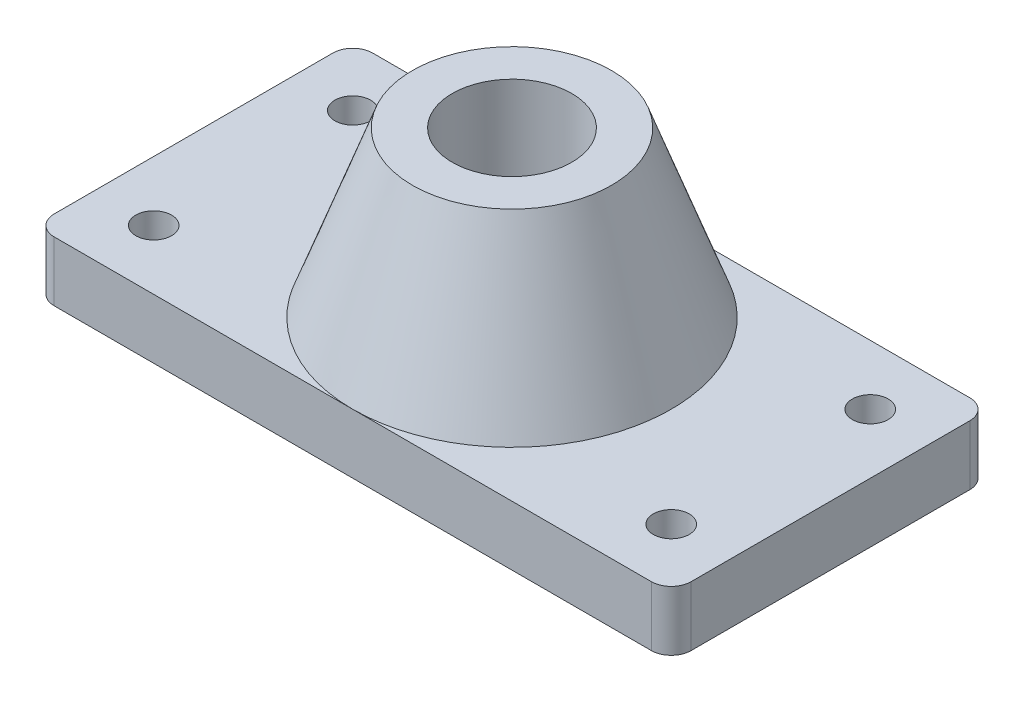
ISO-10303-21;
HEADER;
FILE_DESCRIPTION(('STEP AP214'),'2;1');
FILE_NAME('part.step','',(''),(''),'','','');
FILE_SCHEMA(('AUTOMOTIVE_DESIGN { 1 0 10303 214 1 1 1 1 }'));
ENDSEC;
DATA;
#1=APPLICATION_CONTEXT('core data for automotive mechanical design processes');
#2=APPLICATION_PROTOCOL_DEFINITION('international standard','automotive_design',2000,#1);
#3=PRODUCT_CONTEXT('',#1,'mechanical');
#4=PRODUCT('Part','Part','',(#3));
#5=PRODUCT_RELATED_PRODUCT_CATEGORY('part','',(#4));
#6=PRODUCT_DEFINITION_FORMATION('','',#4);
#7=PRODUCT_DEFINITION_CONTEXT('part definition',#1,'design');
#8=PRODUCT_DEFINITION('design','',#6,#7);
#9=PRODUCT_DEFINITION_SHAPE('','',#8);
#10=(LENGTH_UNIT() NAMED_UNIT(*) SI_UNIT(.MILLI.,.METRE.));
#11=(NAMED_UNIT(*) PLANE_ANGLE_UNIT() SI_UNIT($,.RADIAN.));
#12=(NAMED_UNIT(*) SI_UNIT($,.STERADIAN.) SOLID_ANGLE_UNIT());
#13=UNCERTAINTY_MEASURE_WITH_UNIT(LENGTH_MEASURE(1.E-05),#10,'distance_accuracy_value','');
#14=(GEOMETRIC_REPRESENTATION_CONTEXT(3) GLOBAL_UNCERTAINTY_ASSIGNED_CONTEXT((#13)) GLOBAL_UNIT_ASSIGNED_CONTEXT((#10,
#11,#12)) REPRESENTATION_CONTEXT('',''));
#15=CARTESIAN_POINT('',(0.,0.,0.));
#16=DIRECTION('',(0.,0.,1.));
#17=DIRECTION('',(1.,0.,0.));
#18=AXIS2_PLACEMENT_3D('',#15,#16,#17);
#19=CARTESIAN_POINT('',(0.,15.,0.));
#20=DIRECTION('',(0.,-1.,0.));
#21=DIRECTION('',(0.,0.,-1.));
#22=AXIS2_PLACEMENT_3D('',#19,#20,#21);
#23=PLANE('',#22);
#24=CARTESIAN_POINT('',(-15.,15.,-25.));
#25=DIRECTION('',(0.,-1.,0.));
#26=DIRECTION('',(0.,0.,-1.));
#27=AXIS2_PLACEMENT_3D('',#24,#25,#26);
#28=CIRCLE('',#27,4.49999999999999);
#29=CARTESIAN_POINT('',(-15.,15.,-29.5));
#30=VERTEX_POINT('',#29);
#31=EDGE_CURVE('E159',#30,#30,#28,.T.);
#32=ORIENTED_EDGE('',*,*,#31,.T.);
#33=EDGE_LOOP('',(#32));
#34=FACE_BOUND('',#33,.T.);
#35=CARTESIAN_POINT('',(-15.,15.,25.));
#36=DIRECTION('',(0.,-1.,0.));
#37=DIRECTION('',(0.,0.,-1.));
#38=AXIS2_PLACEMENT_3D('',#35,#36,#37);
#39=CIRCLE('',#38,4.49999999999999);
#40=CARTESIAN_POINT('',(-15.,15.,20.5));
#41=VERTEX_POINT('',#40);
#42=EDGE_CURVE('E154',#41,#41,#39,.T.);
#43=ORIENTED_EDGE('',*,*,#42,.T.);
#44=EDGE_LOOP('',(#43));
#45=FACE_BOUND('',#44,.T.);
#46=DIRECTION('',(0.,0.,-1.));
#47=VECTOR('',#46,1.);
#48=CARTESIAN_POINT('',(0.,15.,-40.));
#49=LINE('',#48,#47);
#50=CARTESIAN_POINT('',(0.,15.,35.));
#51=VERTEX_POINT('',#50);
#52=CARTESIAN_POINT('',(0.,15.,-35.));
#53=VERTEX_POINT('',#52);
#54=EDGE_CURVE('E150',#51,#53,#49,.T.);
#55=ORIENTED_EDGE('',*,*,#54,.T.);
#56=CARTESIAN_POINT('',(-5.,15.,-35.));
#57=DIRECTION('',(0.,-1.,0.));
#58=DIRECTION('',(0.,0.,-1.));
#59=AXIS2_PLACEMENT_3D('',#56,#57,#58);
#60=CIRCLE('',#59,5.);
#61=CARTESIAN_POINT('',(-5.,15.,-40.));
#62=VERTEX_POINT('',#61);
#63=EDGE_CURVE('E11',#53,#62,#60,.F.);
#64=ORIENTED_EDGE('',*,*,#63,.T.);
#65=DIRECTION('',(-1.,0.,0.));
#66=VECTOR('',#65,1.);
#67=CARTESIAN_POINT('',(-160.,15.,-40.));
#68=LINE('',#67,#66);
#69=CARTESIAN_POINT('',(-80.,15.,-40.));
#70=VERTEX_POINT('',#69);
#71=EDGE_CURVE('E128',#62,#70,#68,.T.);
#72=ORIENTED_EDGE('',*,*,#71,.T.);
#73=CARTESIAN_POINT('',(-80.,15.,0.));
#74=DIRECTION('',(0.,-1.,0.));
#75=DIRECTION('',(0.,0.,-1.));
#76=AXIS2_PLACEMENT_3D('',#73,#74,#75);
#77=CIRCLE('',#76,40.);
#78=CARTESIAN_POINT('',(-80.,15.,40.));
#79=VERTEX_POINT('',#78);
#80=EDGE_CURVE('E124',#70,#79,#77,.T.);
#81=ORIENTED_EDGE('',*,*,#80,.T.);
#82=DIRECTION('',(1.,0.,0.));
#83=VECTOR('',#82,1.);
#84=CARTESIAN_POINT('',(0.,15.,40.));
#85=LINE('',#84,#83);
#86=CARTESIAN_POINT('',(-5.,15.,40.));
#87=VERTEX_POINT('',#86);
#88=EDGE_CURVE('E117',#79,#87,#85,.T.);
#89=ORIENTED_EDGE('',*,*,#88,.T.);
#90=CARTESIAN_POINT('',(-5.,15.,35.));
#91=DIRECTION('',(0.,-1.,0.));
#92=DIRECTION('',(0.,0.,-1.));
#93=AXIS2_PLACEMENT_3D('',#90,#91,#92);
#94=CIRCLE('',#93,5.);
#95=EDGE_CURVE('E41',#87,#51,#94,.F.);
#96=ORIENTED_EDGE('',*,*,#95,.T.);
#97=EDGE_LOOP('',(#55,#64,#72,#81,#89,#96));
#98=FACE_BOUND('',#97,.T.);
#99=ADVANCED_FACE('F33',(#34,#45,#98),#23,.F.);
#100=CARTESIAN_POINT('',(-160.,15.,-40.));
#101=DIRECTION('',(0.,0.,1.));
#102=DIRECTION('',(1.,0.,0.));
#103=AXIS2_PLACEMENT_3D('',#100,#101,#102);
#104=PLANE('',#103);
#105=DIRECTION('',(-1.,0.,0.));
#106=VECTOR('',#105,1.);
#107=CARTESIAN_POINT('',(-160.,0.,-40.));
#108=LINE('',#107,#106);
#109=CARTESIAN_POINT('',(-5.,0.,-40.));
#110=VERTEX_POINT('',#109);
#111=CARTESIAN_POINT('',(-155.,0.,-40.));
#112=VERTEX_POINT('',#111);
#113=EDGE_CURVE('E139',#110,#112,#108,.T.);
#114=ORIENTED_EDGE('',*,*,#113,.T.);
#115=DIRECTION('',(0.,-1.,0.));
#116=VECTOR('',#115,1.);
#117=CARTESIAN_POINT('',(-155.,15.,-40.));
#118=LINE('',#117,#116);
#119=CARTESIAN_POINT('',(-155.,15.,-40.));
#120=VERTEX_POINT('',#119);
#121=EDGE_CURVE('E184',#112,#120,#118,.F.);
#122=ORIENTED_EDGE('',*,*,#121,.T.);
#123=EDGE_CURVE('E211',#70,#120,#68,.T.);
#124=ORIENTED_EDGE('',*,*,#123,.F.);
#125=ORIENTED_EDGE('',*,*,#71,.F.);
#126=DIRECTION('',(0.,-1.,0.));
#127=VECTOR('',#126,1.);
#128=CARTESIAN_POINT('',(-5.,15.,-40.));
#129=LINE('',#128,#127);
#130=EDGE_CURVE('E181',#62,#110,#129,.T.);
#131=ORIENTED_EDGE('',*,*,#130,.T.);
#132=EDGE_LOOP('',(#114,#122,#124,#125,#131));
#133=FACE_BOUND('',#132,.T.);
#134=ADVANCED_FACE('F209',(#133),#104,.F.);
#135=CARTESIAN_POINT('',(-160.,15.,40.));
#136=DIRECTION('',(1.,0.,0.));
#137=DIRECTION('',(0.,0.,-1.));
#138=AXIS2_PLACEMENT_3D('',#135,#136,#137);
#139=PLANE('',#138);
#140=DIRECTION('',(0.,0.,1.));
#141=VECTOR('',#140,1.);
#142=CARTESIAN_POINT('',(-160.,15.,40.));
#143=LINE('',#142,#141);
#144=CARTESIAN_POINT('',(-160.,15.,-35.));
#145=VERTEX_POINT('',#144);
#146=CARTESIAN_POINT('',(-160.,15.,35.));
#147=VERTEX_POINT('',#146);
#148=EDGE_CURVE('E135',#145,#147,#143,.T.);
#149=ORIENTED_EDGE('',*,*,#148,.F.);
#150=DIRECTION('',(0.,-1.,0.));
#151=VECTOR('',#150,1.);
#152=CARTESIAN_POINT('',(-160.,15.,-35.));
#153=LINE('',#152,#151);
#154=CARTESIAN_POINT('',(-160.,0.,-35.));
#155=VERTEX_POINT('',#154);
#156=EDGE_CURVE('E170',#145,#155,#153,.T.);
#157=ORIENTED_EDGE('',*,*,#156,.T.);
#158=DIRECTION('',(0.,0.,1.));
#159=VECTOR('',#158,1.);
#160=CARTESIAN_POINT('',(-160.,0.,40.));
#161=LINE('',#160,#159);
#162=CARTESIAN_POINT('',(-160.,0.,35.));
#163=VERTEX_POINT('',#162);
#164=EDGE_CURVE('E142',#155,#163,#161,.T.);
#165=ORIENTED_EDGE('',*,*,#164,.T.);
#166=DIRECTION('',(0.,-1.,0.));
#167=VECTOR('',#166,1.);
#168=CARTESIAN_POINT('',(-160.,15.,35.));
#169=LINE('',#168,#167);
#170=EDGE_CURVE('E125',#163,#147,#169,.F.);
#171=ORIENTED_EDGE('',*,*,#170,.T.);
#172=EDGE_LOOP('',(#149,#157,#165,#171));
#173=FACE_BOUND('',#172,.T.);
#174=ADVANCED_FACE('F275',(#173),#139,.F.);
#175=CARTESIAN_POINT('',(0.,15.,40.));
#176=DIRECTION('',(0.,0.,-1.));
#177=DIRECTION('',(-1.,0.,0.));
#178=AXIS2_PLACEMENT_3D('',#175,#176,#177);
#179=PLANE('',#178);
#180=CARTESIAN_POINT('',(-155.,15.,40.));
#181=VERTEX_POINT('',#180);
#182=EDGE_CURVE('E104',#181,#79,#85,.T.);
#183=ORIENTED_EDGE('',*,*,#182,.F.);
#184=DIRECTION('',(0.,-1.,0.));
#185=VECTOR('',#184,1.);
#186=CARTESIAN_POINT('',(-155.,15.,40.));
#187=LINE('',#186,#185);
#188=CARTESIAN_POINT('',(-155.,0.,40.));
#189=VERTEX_POINT('',#188);
#190=EDGE_CURVE('E190',#181,#189,#187,.T.);
#191=ORIENTED_EDGE('',*,*,#190,.T.);
#192=DIRECTION('',(1.,0.,0.));
#193=VECTOR('',#192,1.);
#194=CARTESIAN_POINT('',(0.,0.,40.));
#195=LINE('',#194,#193);
#196=CARTESIAN_POINT('',(-5.,0.,40.));
#197=VERTEX_POINT('',#196);
#198=EDGE_CURVE('E146',#189,#197,#195,.T.);
#199=ORIENTED_EDGE('',*,*,#198,.T.);
#200=DIRECTION('',(0.,-1.,0.));
#201=VECTOR('',#200,1.);
#202=CARTESIAN_POINT('',(-5.,15.,40.));
#203=LINE('',#202,#201);
#204=EDGE_CURVE('E134',#197,#87,#203,.F.);
#205=ORIENTED_EDGE('',*,*,#204,.T.);
#206=ORIENTED_EDGE('',*,*,#88,.F.);
#207=EDGE_LOOP('',(#183,#191,#199,#205,#206));
#208=FACE_BOUND('',#207,.T.);
#209=ADVANCED_FACE('F131',(#208),#179,.F.);
#210=CARTESIAN_POINT('',(0.,15.,0.));
#211=DIRECTION('',(-1.,0.,0.));
#212=DIRECTION('',(0.,0.,1.));
#213=AXIS2_PLACEMENT_3D('',#210,#211,#212);
#214=PLANE('',#213);
#215=DIRECTION('',(0.,0.,-1.));
#216=VECTOR('',#215,1.);
#217=CARTESIAN_POINT('',(0.,0.,0.));
#218=LINE('',#217,#216);
#219=CARTESIAN_POINT('',(0.,0.,35.));
#220=VERTEX_POINT('',#219);
#221=CARTESIAN_POINT('',(0.,0.,-35.));
#222=VERTEX_POINT('',#221);
#223=EDGE_CURVE('E148',#220,#222,#218,.T.);
#224=ORIENTED_EDGE('',*,*,#223,.T.);
#225=DIRECTION('',(0.,-1.,0.));
#226=VECTOR('',#225,1.);
#227=CARTESIAN_POINT('',(0.,15.,-35.));
#228=LINE('',#227,#226);
#229=EDGE_CURVE('E48',#222,#53,#228,.F.);
#230=ORIENTED_EDGE('',*,*,#229,.T.);
#231=ORIENTED_EDGE('',*,*,#54,.F.);
#232=DIRECTION('',(0.,-1.,0.));
#233=VECTOR('',#232,1.);
#234=CARTESIAN_POINT('',(0.,15.,35.));
#235=LINE('',#234,#233);
#236=EDGE_CURVE('E192',#51,#220,#235,.T.);
#237=ORIENTED_EDGE('',*,*,#236,.T.);
#238=EDGE_LOOP('',(#224,#230,#231,#237));
#239=FACE_BOUND('',#238,.T.);
#240=ADVANCED_FACE('F197',(#239),#214,.F.);
#241=CARTESIAN_POINT('',(-145.,15.,-25.));
#242=DIRECTION('',(0.,-1.,0.));
#243=DIRECTION('',(0.,0.,-1.));
#244=AXIS2_PLACEMENT_3D('',#241,#242,#243);
#245=CIRCLE('',#244,4.49999999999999);
#246=CARTESIAN_POINT('',(-145.,15.,-29.5));
#247=VERTEX_POINT('',#246);
#248=EDGE_CURVE('E164',#247,#247,#245,.T.);
#249=ORIENTED_EDGE('',*,*,#248,.T.);
#250=EDGE_LOOP('',(#249));
#251=FACE_BOUND('',#250,.T.);
#252=CARTESIAN_POINT('',(-145.,15.,25.));
#253=DIRECTION('',(0.,-1.,0.));
#254=DIRECTION('',(0.,0.,-1.));
#255=AXIS2_PLACEMENT_3D('',#252,#253,#254);
#256=CIRCLE('',#255,4.49999999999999);
#257=CARTESIAN_POINT('',(-145.,15.,20.5));
#258=VERTEX_POINT('',#257);
#259=EDGE_CURVE('E130',#258,#258,#256,.T.);
#260=ORIENTED_EDGE('',*,*,#259,.T.);
#261=EDGE_LOOP('',(#260));
#262=FACE_BOUND('',#261,.T.);
#263=ORIENTED_EDGE('',*,*,#123,.T.);
#264=CARTESIAN_POINT('',(-155.,15.,-35.));
#265=DIRECTION('',(0.,-1.,0.));
#266=DIRECTION('',(0.,0.,-1.));
#267=AXIS2_PLACEMENT_3D('',#264,#265,#266);
#268=CIRCLE('',#267,5.);
#269=EDGE_CURVE('E187',#120,#145,#268,.F.);
#270=ORIENTED_EDGE('',*,*,#269,.T.);
#271=ORIENTED_EDGE('',*,*,#148,.T.);
#272=CARTESIAN_POINT('',(-155.,15.,35.));
#273=DIRECTION('',(0.,-1.,0.));
#274=DIRECTION('',(0.,0.,-1.));
#275=AXIS2_PLACEMENT_3D('',#272,#273,#274);
#276=CIRCLE('',#275,5.);
#277=EDGE_CURVE('E112',#147,#181,#276,.F.);
#278=ORIENTED_EDGE('',*,*,#277,.T.);
#279=ORIENTED_EDGE('',*,*,#182,.T.);
#280=EDGE_CURVE('E108',#79,#70,#77,.T.);
#281=ORIENTED_EDGE('',*,*,#280,.T.);
#282=EDGE_LOOP('',(#263,#270,#271,#278,#279,#281));
#283=FACE_BOUND('',#282,.T.);
#284=ADVANCED_FACE('F107',(#251,#262,#283),#23,.F.);
#285=CARTESIAN_POINT('',(0.,0.,0.));
#286=DIRECTION('',(0.,-1.,0.));
#287=DIRECTION('',(0.,0.,-1.));
#288=AXIS2_PLACEMENT_3D('',#285,#286,#287);
#289=PLANE('',#288);
#290=CARTESIAN_POINT('',(-80.,0.,0.));
#291=DIRECTION('',(0.,1.,0.));
#292=DIRECTION('',(0.,0.,1.));
#293=AXIS2_PLACEMENT_3D('',#290,#291,#292);
#294=CIRCLE('',#293,15.);
#295=CARTESIAN_POINT('',(-80.,0.,15.));
#296=VERTEX_POINT('',#295);
#297=EDGE_CURVE('E247',#296,#296,#294,.T.);
#298=ORIENTED_EDGE('',*,*,#297,.T.);
#299=EDGE_LOOP('',(#298));
#300=FACE_BOUND('',#299,.T.);
#301=CARTESIAN_POINT('',(-145.,0.,-25.));
#302=DIRECTION('',(0.,-1.,0.));
#303=DIRECTION('',(0.,0.,-1.));
#304=AXIS2_PLACEMENT_3D('',#301,#302,#303);
#305=CIRCLE('',#304,7.50000000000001);
#306=CARTESIAN_POINT('',(-145.,0.,-32.5));
#307=VERTEX_POINT('',#306);
#308=EDGE_CURVE('E244',#307,#307,#305,.T.);
#309=ORIENTED_EDGE('',*,*,#308,.F.);
#310=EDGE_LOOP('',(#309));
#311=FACE_BOUND('',#310,.T.);
#312=CARTESIAN_POINT('',(-15.,0.,-25.));
#313=DIRECTION('',(0.,-1.,0.));
#314=DIRECTION('',(0.,0.,-1.));
#315=AXIS2_PLACEMENT_3D('',#312,#313,#314);
#316=CIRCLE('',#315,7.5);
#317=CARTESIAN_POINT('',(-15.,0.,-32.5));
#318=VERTEX_POINT('',#317);
#319=EDGE_CURVE('E167',#318,#318,#316,.T.);
#320=ORIENTED_EDGE('',*,*,#319,.F.);
#321=EDGE_LOOP('',(#320));
#322=FACE_BOUND('',#321,.T.);
#323=CARTESIAN_POINT('',(-15.,0.,25.));
#324=DIRECTION('',(0.,-1.,0.));
#325=DIRECTION('',(0.,0.,-1.));
#326=AXIS2_PLACEMENT_3D('',#323,#324,#325);
#327=CIRCLE('',#326,7.5);
#328=CARTESIAN_POINT('',(-15.,0.,17.5));
#329=VERTEX_POINT('',#328);
#330=EDGE_CURVE('E162',#329,#329,#327,.T.);
#331=ORIENTED_EDGE('',*,*,#330,.F.);
#332=EDGE_LOOP('',(#331));
#333=FACE_BOUND('',#332,.T.);
#334=CARTESIAN_POINT('',(-145.,0.,25.));
#335=DIRECTION('',(0.,-1.,0.));
#336=DIRECTION('',(0.,0.,-1.));
#337=AXIS2_PLACEMENT_3D('',#334,#335,#336);
#338=CIRCLE('',#337,7.50000000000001);
#339=CARTESIAN_POINT('',(-145.,0.,17.5));
#340=VERTEX_POINT('',#339);
#341=EDGE_CURVE('E157',#340,#340,#338,.T.);
#342=ORIENTED_EDGE('',*,*,#341,.F.);
#343=EDGE_LOOP('',(#342));
#344=FACE_BOUND('',#343,.T.);
#345=ORIENTED_EDGE('',*,*,#164,.F.);
#346=CARTESIAN_POINT('',(-155.,0.,-35.));
#347=DIRECTION('',(0.,-1.,0.));
#348=DIRECTION('',(0.,0.,-1.));
#349=AXIS2_PLACEMENT_3D('',#346,#347,#348);
#350=CIRCLE('',#349,5.);
#351=EDGE_CURVE('E179',#155,#112,#350,.T.);
#352=ORIENTED_EDGE('',*,*,#351,.T.);
#353=ORIENTED_EDGE('',*,*,#113,.F.);
#354=CARTESIAN_POINT('',(-5.,0.,-35.));
#355=DIRECTION('',(0.,-1.,0.));
#356=DIRECTION('',(0.,0.,-1.));
#357=AXIS2_PLACEMENT_3D('',#354,#355,#356);
#358=CIRCLE('',#357,5.);
#359=EDGE_CURVE('E175',#110,#222,#358,.T.);
#360=ORIENTED_EDGE('',*,*,#359,.T.);
#361=ORIENTED_EDGE('',*,*,#223,.F.);
#362=CARTESIAN_POINT('',(-5.,0.,35.));
#363=DIRECTION('',(0.,-1.,0.));
#364=DIRECTION('',(0.,0.,-1.));
#365=AXIS2_PLACEMENT_3D('',#362,#363,#364);
#366=CIRCLE('',#365,5.);
#367=EDGE_CURVE('E173',#220,#197,#366,.T.);
#368=ORIENTED_EDGE('',*,*,#367,.T.);
#369=ORIENTED_EDGE('',*,*,#198,.F.);
#370=CARTESIAN_POINT('',(-155.,0.,35.));
#371=DIRECTION('',(0.,-1.,0.));
#372=DIRECTION('',(0.,0.,-1.));
#373=AXIS2_PLACEMENT_3D('',#370,#371,#372);
#374=CIRCLE('',#373,5.);
#375=EDGE_CURVE('E177',#189,#163,#374,.T.);
#376=ORIENTED_EDGE('',*,*,#375,.T.);
#377=EDGE_LOOP('',(#345,#352,#353,#360,#361,#368,#369,#376));
#378=FACE_BOUND('',#377,.T.);
#379=ADVANCED_FACE('F201',(#300,#311,#322,#333,#344,#378),#289,.T.);
#380=CARTESIAN_POINT('',(-80.,56.2121612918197,0.));
#381=DIRECTION('',(0.,-1.,0.));
#382=DIRECTION('',(0.,0.,-1.));
#383=AXIS2_PLACEMENT_3D('',#380,#381,#382);
#384=CONICAL_SURFACE('',#383,25.,0.349065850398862);
#385=ORIENTED_EDGE('',*,*,#80,.F.);
#386=ORIENTED_EDGE('',*,*,#280,.F.);
#387=EDGE_LOOP('',(#385,#386));
#388=FACE_BOUND('',#387,.T.);
#389=CARTESIAN_POINT('',(-80.,56.2121612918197,0.));
#390=DIRECTION('',(0.,-1.,0.));
#391=DIRECTION('',(0.,0.,-1.));
#392=AXIS2_PLACEMENT_3D('',#389,#390,#391);
#393=CIRCLE('',#392,25.);
#394=CARTESIAN_POINT('',(-80.,56.2121612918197,-25.));
#395=VERTEX_POINT('',#394);
#396=EDGE_CURVE('E143',#395,#395,#393,.T.);
#397=ORIENTED_EDGE('',*,*,#396,.T.);
#398=EDGE_LOOP('',(#397));
#399=FACE_BOUND('',#398,.T.);
#400=ADVANCED_FACE('F122',(#388,#399),#384,.T.);
#401=CARTESIAN_POINT('',(-105.,56.2121612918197,0.));
#402=DIRECTION('',(0.,-1.,0.));
#403=DIRECTION('',(0.,0.,-1.));
#404=AXIS2_PLACEMENT_3D('',#401,#402,#403);
#405=PLANE('',#404);
#406=ORIENTED_EDGE('',*,*,#396,.F.);
#407=EDGE_LOOP('',(#406));
#408=FACE_BOUND('',#407,.T.);
#409=CARTESIAN_POINT('',(-80.,56.2121612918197,0.));
#410=DIRECTION('',(0.,-1.,0.));
#411=DIRECTION('',(0.,0.,-1.));
#412=AXIS2_PLACEMENT_3D('',#409,#410,#411);
#413=CIRCLE('',#412,15.);
#414=CARTESIAN_POINT('',(-80.,56.2121612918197,-15.));
#415=VERTEX_POINT('',#414);
#416=EDGE_CURVE('E129',#415,#415,#413,.T.);
#417=ORIENTED_EDGE('',*,*,#416,.T.);
#418=EDGE_LOOP('',(#417));
#419=FACE_BOUND('',#418,.T.);
#420=ADVANCED_FACE('F256',(#408,#419),#405,.F.);
#421=CARTESIAN_POINT('',(-80.,0.,0.));
#422=DIRECTION('',(0.,-1.,0.));
#423=DIRECTION('',(0.,0.,-1.));
#424=AXIS2_PLACEMENT_3D('',#421,#422,#423);
#425=CYLINDRICAL_SURFACE('',#424,15.);
#426=ORIENTED_EDGE('',*,*,#416,.F.);
#427=EDGE_LOOP('',(#426));
#428=FACE_BOUND('',#427,.T.);
#429=ORIENTED_EDGE('',*,*,#297,.F.);
#430=EDGE_LOOP('',(#429));
#431=FACE_BOUND('',#430,.T.);
#432=ADVANCED_FACE('F253',(#428,#431),#425,.F.);
#433=CARTESIAN_POINT('',(-145.,0.,25.));
#434=DIRECTION('',(0.,-1.,0.));
#435=DIRECTION('',(0.,0.,-1.));
#436=AXIS2_PLACEMENT_3D('',#433,#434,#435);
#437=CYLINDRICAL_SURFACE('',#436,4.49999999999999);
#438=CARTESIAN_POINT('',(-145.,8.6,25.));
#439=DIRECTION('',(0.,-1.,0.));
#440=DIRECTION('',(0.,0.,-1.));
#441=AXIS2_PLACEMENT_3D('',#438,#439,#440);
#442=CIRCLE('',#441,4.5);
#443=CARTESIAN_POINT('',(-145.,8.6,20.5));
#444=VERTEX_POINT('',#443);
#445=EDGE_CURVE('E153',#444,#444,#442,.T.);
#446=ORIENTED_EDGE('',*,*,#445,.T.);
#447=EDGE_LOOP('',(#446));
#448=FACE_BOUND('',#447,.T.);
#449=ORIENTED_EDGE('',*,*,#259,.F.);
#450=EDGE_LOOP('',(#449));
#451=FACE_BOUND('',#450,.T.);
#452=ADVANCED_FACE('F255',(#448,#451),#437,.F.);
#453=CARTESIAN_POINT('',(-140.5,8.6,25.));
#454=DIRECTION('',(0.,1.,0.));
#455=DIRECTION('',(0.,0.,1.));
#456=AXIS2_PLACEMENT_3D('',#453,#454,#455);
#457=PLANE('',#456);
#458=ORIENTED_EDGE('',*,*,#445,.F.);
#459=EDGE_LOOP('',(#458));
#460=FACE_BOUND('',#459,.T.);
#461=CARTESIAN_POINT('',(-145.,8.6,25.));
#462=DIRECTION('',(0.,-1.,0.));
#463=DIRECTION('',(0.,0.,-1.));
#464=AXIS2_PLACEMENT_3D('',#461,#462,#463);
#465=CIRCLE('',#464,7.50000000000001);
#466=CARTESIAN_POINT('',(-145.,8.6,17.5));
#467=VERTEX_POINT('',#466);
#468=EDGE_CURVE('E220',#467,#467,#465,.T.);
#469=ORIENTED_EDGE('',*,*,#468,.T.);
#470=EDGE_LOOP('',(#469));
#471=FACE_BOUND('',#470,.T.);
#472=ADVANCED_FACE('F263',(#460,#471),#457,.F.);
#473=CARTESIAN_POINT('',(-145.,0.,25.));
#474=DIRECTION('',(0.,-1.,0.));
#475=DIRECTION('',(0.,0.,-1.));
#476=AXIS2_PLACEMENT_3D('',#473,#474,#475);
#477=CYLINDRICAL_SURFACE('',#476,7.50000000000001);
#478=ORIENTED_EDGE('',*,*,#468,.F.);
#479=EDGE_LOOP('',(#478));
#480=FACE_BOUND('',#479,.T.);
#481=ORIENTED_EDGE('',*,*,#341,.T.);
#482=EDGE_LOOP('',(#481));
#483=FACE_BOUND('',#482,.T.);
#484=ADVANCED_FACE('F328',(#480,#483),#477,.F.);
#485=CARTESIAN_POINT('',(-15.,0.,25.));
#486=DIRECTION('',(0.,-1.,0.));
#487=DIRECTION('',(0.,0.,-1.));
#488=AXIS2_PLACEMENT_3D('',#485,#486,#487);
#489=CYLINDRICAL_SURFACE('',#488,4.49999999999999);
#490=CARTESIAN_POINT('',(-15.,8.6,25.));
#491=DIRECTION('',(0.,-1.,0.));
#492=DIRECTION('',(0.,0.,-1.));
#493=AXIS2_PLACEMENT_3D('',#490,#491,#492);
#494=CIRCLE('',#493,4.5);
#495=CARTESIAN_POINT('',(-15.,8.6,20.5));
#496=VERTEX_POINT('',#495);
#497=EDGE_CURVE('E158',#496,#496,#494,.T.);
#498=ORIENTED_EDGE('',*,*,#497,.T.);
#499=EDGE_LOOP('',(#498));
#500=FACE_BOUND('',#499,.T.);
#501=ORIENTED_EDGE('',*,*,#42,.F.);
#502=EDGE_LOOP('',(#501));
#503=FACE_BOUND('',#502,.T.);
#504=ADVANCED_FACE('F324',(#500,#503),#489,.F.);
#505=CARTESIAN_POINT('',(-10.5,8.6,25.));
#506=DIRECTION('',(0.,1.,0.));
#507=DIRECTION('',(0.,0.,1.));
#508=AXIS2_PLACEMENT_3D('',#505,#506,#507);
#509=PLANE('',#508);
#510=ORIENTED_EDGE('',*,*,#497,.F.);
#511=EDGE_LOOP('',(#510));
#512=FACE_BOUND('',#511,.T.);
#513=CARTESIAN_POINT('',(-15.,8.6,25.));
#514=DIRECTION('',(0.,-1.,0.));
#515=DIRECTION('',(0.,0.,-1.));
#516=AXIS2_PLACEMENT_3D('',#513,#514,#515);
#517=CIRCLE('',#516,7.5);
#518=CARTESIAN_POINT('',(-15.,8.6,17.5));
#519=VERTEX_POINT('',#518);
#520=EDGE_CURVE('E227',#519,#519,#517,.T.);
#521=ORIENTED_EDGE('',*,*,#520,.T.);
#522=EDGE_LOOP('',(#521));
#523=FACE_BOUND('',#522,.T.);
#524=ADVANCED_FACE('F320',(#512,#523),#509,.F.);
#525=CARTESIAN_POINT('',(-15.,0.,25.));
#526=DIRECTION('',(0.,-1.,0.));
#527=DIRECTION('',(0.,0.,-1.));
#528=AXIS2_PLACEMENT_3D('',#525,#526,#527);
#529=CYLINDRICAL_SURFACE('',#528,7.5);
#530=ORIENTED_EDGE('',*,*,#520,.F.);
#531=EDGE_LOOP('',(#530));
#532=FACE_BOUND('',#531,.T.);
#533=ORIENTED_EDGE('',*,*,#330,.T.);
#534=EDGE_LOOP('',(#533));
#535=FACE_BOUND('',#534,.T.);
#536=ADVANCED_FACE('F316',(#532,#535),#529,.F.);
#537=CARTESIAN_POINT('',(-15.,0.,-25.));
#538=DIRECTION('',(0.,-1.,0.));
#539=DIRECTION('',(0.,0.,-1.));
#540=AXIS2_PLACEMENT_3D('',#537,#538,#539);
#541=CYLINDRICAL_SURFACE('',#540,4.49999999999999);
#542=CARTESIAN_POINT('',(-15.,8.6,-25.));
#543=DIRECTION('',(0.,-1.,0.));
#544=DIRECTION('',(0.,0.,-1.));
#545=AXIS2_PLACEMENT_3D('',#542,#543,#544);
#546=CIRCLE('',#545,4.5);
#547=CARTESIAN_POINT('',(-15.,8.6,-29.5));
#548=VERTEX_POINT('',#547);
#549=EDGE_CURVE('E163',#548,#548,#546,.T.);
#550=ORIENTED_EDGE('',*,*,#549,.T.);
#551=EDGE_LOOP('',(#550));
#552=FACE_BOUND('',#551,.T.);
#553=ORIENTED_EDGE('',*,*,#31,.F.);
#554=EDGE_LOOP('',(#553));
#555=FACE_BOUND('',#554,.T.);
#556=ADVANCED_FACE('F312',(#552,#555),#541,.F.);
#557=CARTESIAN_POINT('',(-10.5,8.6,-25.));
#558=DIRECTION('',(0.,1.,0.));
#559=DIRECTION('',(0.,0.,1.));
#560=AXIS2_PLACEMENT_3D('',#557,#558,#559);
#561=PLANE('',#560);
#562=ORIENTED_EDGE('',*,*,#549,.F.);
#563=EDGE_LOOP('',(#562));
#564=FACE_BOUND('',#563,.T.);
#565=CARTESIAN_POINT('',(-15.,8.6,-25.));
#566=DIRECTION('',(0.,-1.,0.));
#567=DIRECTION('',(0.,0.,-1.));
#568=AXIS2_PLACEMENT_3D('',#565,#566,#567);
#569=CIRCLE('',#568,7.5);
#570=CARTESIAN_POINT('',(-15.,8.6,-32.5));
#571=VERTEX_POINT('',#570);
#572=EDGE_CURVE('E234',#571,#571,#569,.T.);
#573=ORIENTED_EDGE('',*,*,#572,.T.);
#574=EDGE_LOOP('',(#573));
#575=FACE_BOUND('',#574,.T.);
#576=ADVANCED_FACE('F305',(#564,#575),#561,.F.);
#577=CARTESIAN_POINT('',(-15.,0.,-25.));
#578=DIRECTION('',(0.,-1.,0.));
#579=DIRECTION('',(0.,0.,-1.));
#580=AXIS2_PLACEMENT_3D('',#577,#578,#579);
#581=CYLINDRICAL_SURFACE('',#580,7.5);
#582=ORIENTED_EDGE('',*,*,#572,.F.);
#583=EDGE_LOOP('',(#582));
#584=FACE_BOUND('',#583,.T.);
#585=ORIENTED_EDGE('',*,*,#319,.T.);
#586=EDGE_LOOP('',(#585));
#587=FACE_BOUND('',#586,.T.);
#588=ADVANCED_FACE('F295',(#584,#587),#581,.F.);
#589=CARTESIAN_POINT('',(-145.,0.,-25.));
#590=DIRECTION('',(0.,-1.,0.));
#591=DIRECTION('',(0.,0.,-1.));
#592=AXIS2_PLACEMENT_3D('',#589,#590,#591);
#593=CYLINDRICAL_SURFACE('',#592,4.49999999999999);
#594=CARTESIAN_POINT('',(-145.,8.6,-25.));
#595=DIRECTION('',(0.,-1.,0.));
#596=DIRECTION('',(0.,0.,-1.));
#597=AXIS2_PLACEMENT_3D('',#594,#595,#596);
#598=CIRCLE('',#597,4.5);
#599=CARTESIAN_POINT('',(-145.,8.6,-29.5));
#600=VERTEX_POINT('',#599);
#601=EDGE_CURVE('E168',#600,#600,#598,.T.);
#602=ORIENTED_EDGE('',*,*,#601,.T.);
#603=EDGE_LOOP('',(#602));
#604=FACE_BOUND('',#603,.T.);
#605=ORIENTED_EDGE('',*,*,#248,.F.);
#606=EDGE_LOOP('',(#605));
#607=FACE_BOUND('',#606,.T.);
#608=ADVANCED_FACE('F292',(#604,#607),#593,.F.);
#609=CARTESIAN_POINT('',(-140.5,8.6,-25.));
#610=DIRECTION('',(0.,1.,0.));
#611=DIRECTION('',(0.,0.,1.));
#612=AXIS2_PLACEMENT_3D('',#609,#610,#611);
#613=PLANE('',#612);
#614=ORIENTED_EDGE('',*,*,#601,.F.);
#615=EDGE_LOOP('',(#614));
#616=FACE_BOUND('',#615,.T.);
#617=CARTESIAN_POINT('',(-145.,8.6,-25.));
#618=DIRECTION('',(0.,-1.,0.));
#619=DIRECTION('',(0.,0.,-1.));
#620=AXIS2_PLACEMENT_3D('',#617,#618,#619);
#621=CIRCLE('',#620,7.50000000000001);
#622=CARTESIAN_POINT('',(-145.,8.6,-32.5));
#623=VERTEX_POINT('',#622);
#624=EDGE_CURVE('E241',#623,#623,#621,.T.);
#625=ORIENTED_EDGE('',*,*,#624,.T.);
#626=EDGE_LOOP('',(#625));
#627=FACE_BOUND('',#626,.T.);
#628=ADVANCED_FACE('F294',(#616,#627),#613,.F.);
#629=CARTESIAN_POINT('',(-145.,0.,-25.));
#630=DIRECTION('',(0.,-1.,0.));
#631=DIRECTION('',(0.,0.,-1.));
#632=AXIS2_PLACEMENT_3D('',#629,#630,#631);
#633=CYLINDRICAL_SURFACE('',#632,7.50000000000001);
#634=ORIENTED_EDGE('',*,*,#624,.F.);
#635=EDGE_LOOP('',(#634));
#636=FACE_BOUND('',#635,.T.);
#637=ORIENTED_EDGE('',*,*,#308,.T.);
#638=EDGE_LOOP('',(#637));
#639=FACE_BOUND('',#638,.T.);
#640=ADVANCED_FACE('F302',(#636,#639),#633,.F.);
#641=CARTESIAN_POINT('',(-155.,15.,-35.));
#642=DIRECTION('',(0.,-1.,0.));
#643=DIRECTION('',(0.,0.,-1.));
#644=AXIS2_PLACEMENT_3D('',#641,#642,#643);
#645=CYLINDRICAL_SURFACE('',#644,5.);
#646=ORIENTED_EDGE('',*,*,#269,.F.);
#647=ORIENTED_EDGE('',*,*,#121,.F.);
#648=ORIENTED_EDGE('',*,*,#351,.F.);
#649=ORIENTED_EDGE('',*,*,#156,.F.);
#650=EDGE_LOOP('',(#646,#647,#648,#649));
#651=FACE_BOUND('',#650,.T.);
#652=ADVANCED_FACE('F391',(#651),#645,.T.);
#653=CARTESIAN_POINT('',(-155.,15.,35.));
#654=DIRECTION('',(0.,-1.,0.));
#655=DIRECTION('',(0.,0.,-1.));
#656=AXIS2_PLACEMENT_3D('',#653,#654,#655);
#657=CYLINDRICAL_SURFACE('',#656,5.);
#658=ORIENTED_EDGE('',*,*,#277,.F.);
#659=ORIENTED_EDGE('',*,*,#170,.F.);
#660=ORIENTED_EDGE('',*,*,#375,.F.);
#661=ORIENTED_EDGE('',*,*,#190,.F.);
#662=EDGE_LOOP('',(#658,#659,#660,#661));
#663=FACE_BOUND('',#662,.T.);
#664=ADVANCED_FACE('F441',(#663),#657,.T.);
#665=CARTESIAN_POINT('',(-5.,15.,-35.));
#666=DIRECTION('',(0.,-1.,0.));
#667=DIRECTION('',(0.,0.,-1.));
#668=AXIS2_PLACEMENT_3D('',#665,#666,#667);
#669=CYLINDRICAL_SURFACE('',#668,5.);
#670=ORIENTED_EDGE('',*,*,#63,.F.);
#671=ORIENTED_EDGE('',*,*,#229,.F.);
#672=ORIENTED_EDGE('',*,*,#359,.F.);
#673=ORIENTED_EDGE('',*,*,#130,.F.);
#674=EDGE_LOOP('',(#670,#671,#672,#673));
#675=FACE_BOUND('',#674,.T.);
#676=ADVANCED_FACE('F207',(#675),#669,.T.);
#677=CARTESIAN_POINT('',(-5.,15.,35.));
#678=DIRECTION('',(0.,-1.,0.));
#679=DIRECTION('',(0.,0.,-1.));
#680=AXIS2_PLACEMENT_3D('',#677,#678,#679);
#681=CYLINDRICAL_SURFACE('',#680,5.);
#682=ORIENTED_EDGE('',*,*,#95,.F.);
#683=ORIENTED_EDGE('',*,*,#204,.F.);
#684=ORIENTED_EDGE('',*,*,#367,.F.);
#685=ORIENTED_EDGE('',*,*,#236,.F.);
#686=EDGE_LOOP('',(#682,#683,#684,#685));
#687=FACE_BOUND('',#686,.T.);
#688=ADVANCED_FACE('F35',(#687),#681,.T.);
#689=CLOSED_SHELL('',(#99,#134,#174,#209,#240,#284,#379,#400,#420,#432,#452,#472,#484,#504,#524,
#536,#556,#576,#588,#608,#628,#640,#652,#664,#676,#688));
#690=MANIFOLD_SOLID_BREP('B2',#689);
#691=ADVANCED_BREP_SHAPE_REPRESENTATION('',(#18,#690),#14);
#692=SHAPE_DEFINITION_REPRESENTATION(#9,#691);
ENDSEC;
END-ISO-10303-21;
